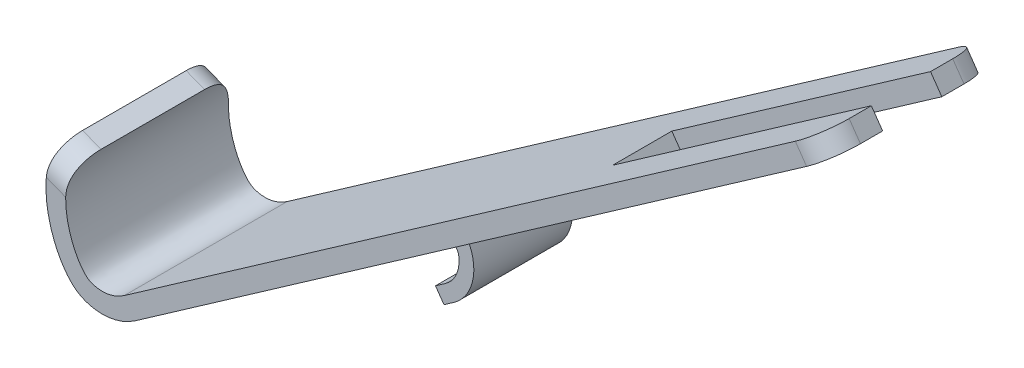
ISO-10303-21;
HEADER;
FILE_DESCRIPTION(('STEP AP214'),'2;1');
FILE_NAME('part.step','',(''),(''),'','','');
FILE_SCHEMA(('AUTOMOTIVE_DESIGN { 1 0 10303 214 1 1 1 1 }'));
ENDSEC;
DATA;
#1=APPLICATION_CONTEXT('core data for automotive mechanical design processes');
#2=APPLICATION_PROTOCOL_DEFINITION('international standard','automotive_design',2000,#1);
#3=PRODUCT_CONTEXT('',#1,'mechanical');
#4=PRODUCT('Part','Part','',(#3));
#5=PRODUCT_RELATED_PRODUCT_CATEGORY('part','',(#4));
#6=PRODUCT_DEFINITION_FORMATION('','',#4);
#7=PRODUCT_DEFINITION_CONTEXT('part definition',#1,'design');
#8=PRODUCT_DEFINITION('design','',#6,#7);
#9=PRODUCT_DEFINITION_SHAPE('','',#8);
#10=(LENGTH_UNIT() NAMED_UNIT(*) SI_UNIT(.MILLI.,.METRE.));
#11=(NAMED_UNIT(*) PLANE_ANGLE_UNIT() SI_UNIT($,.RADIAN.));
#12=(NAMED_UNIT(*) SI_UNIT($,.STERADIAN.) SOLID_ANGLE_UNIT());
#13=UNCERTAINTY_MEASURE_WITH_UNIT(LENGTH_MEASURE(1.E-05),#10,'distance_accuracy_value','');
#14=(GEOMETRIC_REPRESENTATION_CONTEXT(3) GLOBAL_UNCERTAINTY_ASSIGNED_CONTEXT((#13)) GLOBAL_UNIT_ASSIGNED_CONTEXT((#10,
#11,#12)) REPRESENTATION_CONTEXT('',''));
#15=CARTESIAN_POINT('',(0.,0.,0.));
#16=DIRECTION('',(0.,0.,1.));
#17=DIRECTION('',(1.,0.,0.));
#18=AXIS2_PLACEMENT_3D('',#15,#16,#17);
#19=CARTESIAN_POINT('',(49.1890003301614,89.4959440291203,103.384688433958));
#20=DIRECTION('',(0.819556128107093,0.572998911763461,0.));
#21=DIRECTION('',(-0.572998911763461,0.819556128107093,0.));
#22=AXIS2_PLACEMENT_3D('',#19,#20,#21);
#23=PLANE('',#22);
#24=DIRECTION('',(0.572998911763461,-0.819556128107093,0.));
#25=VECTOR('',#24,1.);
#26=CARTESIAN_POINT('',(18.4461324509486,133.467241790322,-3.00000000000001));
#27=LINE('',#26,#25);
#28=CARTESIAN_POINT('',(49.1890003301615,89.4959440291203,-3.00000000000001));
#29=VERTEX_POINT('',#28);
#30=CARTESIAN_POINT('',(50.3349981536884,87.8568317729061,-3.00000000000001));
#31=VERTEX_POINT('',#30);
#32=EDGE_CURVE('E246',#29,#31,#27,.T.);
#33=ORIENTED_EDGE('',*,*,#32,.T.);
#34=DIRECTION('',(0.,0.,-1.));
#35=VECTOR('',#34,1.);
#36=CARTESIAN_POINT('',(50.3349981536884,87.8568317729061,103.384688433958));
#37=LINE('',#36,#35);
#38=CARTESIAN_POINT('',(50.3349981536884,87.8568317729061,-5.24999999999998));
#39=VERTEX_POINT('',#38);
#40=EDGE_CURVE('E307',#31,#39,#37,.T.);
#41=ORIENTED_EDGE('',*,*,#40,.T.);
#42=DIRECTION('',(-0.572998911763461,0.819556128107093,0.));
#43=VECTOR('',#42,1.);
#44=CARTESIAN_POINT('',(49.1890003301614,89.4959440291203,-5.25));
#45=LINE('',#44,#43);
#46=CARTESIAN_POINT('',(49.1890003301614,89.4959440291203,-5.24999999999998));
#47=VERTEX_POINT('',#46);
#48=EDGE_CURVE('E294',#39,#47,#45,.T.);
#49=ORIENTED_EDGE('',*,*,#48,.T.);
#50=DIRECTION('',(0.,0.,-1.));
#51=VECTOR('',#50,1.);
#52=CARTESIAN_POINT('',(49.1890003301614,89.4959440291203,103.384688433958));
#53=LINE('',#52,#51);
#54=EDGE_CURVE('E311',#29,#47,#53,.T.);
#55=ORIENTED_EDGE('',*,*,#54,.F.);
#56=EDGE_LOOP('',(#33,#41,#49,#55));
#57=FACE_BOUND('',#56,.T.);
#58=ADVANCED_FACE('F33',(#57),#23,.T.);
#59=CARTESIAN_POINT('',(-10.7157428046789,-38.1607915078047,8.25));
#60=DIRECTION('',(0.,0.,1.));
#61=DIRECTION('',(1.,0.,0.));
#62=AXIS2_PLACEMENT_3D('',#59,#60,#61);
#63=PLANE('',#62);
#64=CARTESIAN_POINT('',(-20.1468288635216,38.5789253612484,8.25000000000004));
#65=CARTESIAN_POINT('',(-20.9028636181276,38.0503379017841,8.25000000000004));
#66=CARTESIAN_POINT('',(-21.6768857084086,37.7321559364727,8.25000000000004));
#67=CARTESIAN_POINT('',(-23.1458560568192,37.4263890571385,8.25000000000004));
#68=CARTESIAN_POINT('',(-23.8380400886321,37.4370932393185,8.25000000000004));
#69=CARTESIAN_POINT('',(-24.5954630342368,37.5732171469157,8.25000000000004));
#70=CARTESIAN_POINT('',(-24.7417051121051,37.6065813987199,8.25000000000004));
#71=CARTESIAN_POINT('',(-25.0229315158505,37.6837631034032,8.25000000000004));
#72=CARTESIAN_POINT('',(-25.1564534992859,37.7269109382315,8.25000000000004));
#73=CARTESIAN_POINT('',(-25.5510558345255,37.8749184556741,8.25000000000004));
#74=CARTESIAN_POINT('',(-25.8100579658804,38.0033692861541,8.25000000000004));
#75=CARTESIAN_POINT('',(-26.2975902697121,38.3308893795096,8.25000000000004));
#76=CARTESIAN_POINT('',(-26.5248891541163,38.5273727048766,8.25000000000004));
#77=CARTESIAN_POINT('',(-26.9573027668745,38.9755567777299,8.25000000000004));
#78=CARTESIAN_POINT('',(-27.1630045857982,39.2276609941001,8.25000000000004));
#79=CARTESIAN_POINT('',(-27.7521853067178,40.0610591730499,8.25000000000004));
#80=CARTESIAN_POINT('',(-28.1083730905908,40.7199864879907,8.25000000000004));
#81=CARTESIAN_POINT('',(-28.7039991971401,42.2017807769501,8.25000000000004));
#82=CARTESIAN_POINT('',(-28.9425063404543,43.0244901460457,8.25000000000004));
#83=CARTESIAN_POINT('',(-29.2331983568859,44.7820956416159,8.25000000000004));
#84=CARTESIAN_POINT('',(-29.2851650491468,45.7172009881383,8.25000000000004));
#85=CARTESIAN_POINT('',(-29.1242835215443,47.6392769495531,8.25000000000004));
#86=CARTESIAN_POINT('',(-28.9108138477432,48.6264707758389,8.25000000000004));
#87=CARTESIAN_POINT('',(-28.5258299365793,49.6006760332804,8.25000000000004));
#88=B_SPLINE_CURVE_WITH_KNOTS('',3,(#64,#65,#66,#67,#68,#69,#70,#71,#72,#73,#74,#75,#76,#77,#78,
#79,#80,#81,#82,#83,#84,#85,#86,#87),.UNSPECIFIED.,.F.,.F.,(4,2,2,2,2,2,2,2,2,2,2,4),(0.,
0.124999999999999,0.249999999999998,0.281249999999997,0.312499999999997,0.374999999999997,
0.437499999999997,0.499999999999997,0.624999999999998,0.749999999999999,0.874999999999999,1.),.UNSPECIFIED.);
#89=CARTESIAN_POINT('',(-20.1468288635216,38.5789253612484,8.25000000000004));
#90=VERTEX_POINT('',#89);
#91=CARTESIAN_POINT('',(-29.2075103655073,46.6443070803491,8.25000000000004));
#92=VERTEX_POINT('',#91);
#93=EDGE_CURVE('E280',#90,#92,#88,.T.);
#94=ORIENTED_EDGE('',*,*,#93,.F.);
#95=DIRECTION('',(-0.819556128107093,-0.572998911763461,0.));
#96=VECTOR('',#95,1.);
#97=CARTESIAN_POINT('',(50.3349981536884,87.8568317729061,8.25000000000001));
#98=LINE('',#97,#96);
#99=CARTESIAN_POINT('',(47.8763297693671,86.1378350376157,8.25000000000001));
#100=VERTEX_POINT('',#99);
#101=EDGE_CURVE('E273',#100,#90,#98,.T.);
#102=ORIENTED_EDGE('',*,*,#101,.F.);
#103=DIRECTION('',(0.572998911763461,-0.819556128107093,0.));
#104=VECTOR('',#103,1.);
#105=CARTESIAN_POINT('',(87.0101541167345,30.1650139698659,8.25));
#106=LINE('',#105,#104);
#107=CARTESIAN_POINT('',(46.7303319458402,87.7769472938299,8.25000000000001));
#108=VERTEX_POINT('',#107);
#109=EDGE_CURVE('E431',#100,#108,#106,.F.);
#110=ORIENTED_EDGE('',*,*,#109,.T.);
#111=DIRECTION('',(-0.819556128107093,-0.572998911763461,0.));
#112=VECTOR('',#111,1.);
#113=CARTESIAN_POINT('',(49.1890003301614,89.4959440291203,8.25000000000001));
#114=LINE('',#113,#112);
#115=CARTESIAN_POINT('',(-21.2928266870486,40.2180376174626,8.25000000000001));
#116=VERTEX_POINT('',#115);
#117=EDGE_CURVE('E295',#108,#116,#114,.T.);
#118=ORIENTED_EDGE('',*,*,#117,.T.);
#119=CARTESIAN_POINT('',(-21.2928266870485,40.2180376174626,8.25000000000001));
#120=CARTESIAN_POINT('',(-21.8352200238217,39.8388191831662,8.25000000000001));
#121=CARTESIAN_POINT('',(-22.347874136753,39.6353565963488,8.25000000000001));
#122=CARTESIAN_POINT('',(-23.2899983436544,39.4392529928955,8.25000000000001));
#123=CARTESIAN_POINT('',(-23.7222326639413,39.4483228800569,8.25000000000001));
#124=CARTESIAN_POINT('',(-24.1822002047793,39.5309881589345,8.25000000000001));
#125=CARTESIAN_POINT('',(-24.2700296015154,39.5510853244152,8.25000000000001));
#126=CARTESIAN_POINT('',(-24.4359648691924,39.596625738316,8.25000000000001));
#127=CARTESIAN_POINT('',(-24.5152747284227,39.6224747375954,8.25000000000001));
#128=CARTESIAN_POINT('',(-24.7262777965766,39.7016178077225,8.25000000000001));
#129=CARTESIAN_POINT('',(-24.8299822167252,39.7543641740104,8.25000000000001));
#130=CARTESIAN_POINT('',(-24.9928194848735,39.8637568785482,8.25000000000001));
#131=CARTESIAN_POINT('',(-25.0484683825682,39.90584826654,8.25000000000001));
#132=CARTESIAN_POINT('',(-25.1694750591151,40.009205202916,8.25000000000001));
#133=CARTESIAN_POINT('',(-25.2343633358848,40.0702468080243,8.25000000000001));
#134=CARTESIAN_POINT('',(-25.4366322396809,40.2798926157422,8.25000000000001));
#135=CARTESIAN_POINT('',(-25.5813583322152,40.454991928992,8.25000000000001));
#136=CARTESIAN_POINT('',(-26.0161636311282,41.0700255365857,8.25000000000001));
#137=CARTESIAN_POINT('',(-26.3062362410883,41.5991476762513,8.25000000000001));
#138=CARTESIAN_POINT('',(-26.7947464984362,42.8144599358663,8.25000000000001));
#139=CARTESIAN_POINT('',(-26.9941153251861,43.5008076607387,8.25000000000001));
#140=CARTESIAN_POINT('',(-27.2352003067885,44.9584751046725,8.25000000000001));
#141=CARTESIAN_POINT('',(-27.2771346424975,45.729585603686,8.25000000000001));
#142=CARTESIAN_POINT('',(-27.1462527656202,47.2932511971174,8.25000000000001));
#143=CARTESIAN_POINT('',(-26.9740580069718,48.0855830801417,8.25000000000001));
#144=CARTESIAN_POINT('',(-26.6657994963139,48.8656340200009,8.25000000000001));
#145=B_SPLINE_CURVE_WITH_KNOTS('',3,(#119,#120,#121,#122,#123,#124,#125,#126,#127,#128,#129,
#130,#131,#132,#133,#134,#135,#136,#137,#138,#139,#140,#141,#142,#143,#144),.UNSPECIFIED.,.F.,
.F.,(4,2,2,2,2,2,2,2,2,2,2,2,4),(0.,0.124999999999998,0.249999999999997,0.281249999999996,
0.312499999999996,0.374999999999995,0.406249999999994,0.437499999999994,0.499999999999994,
0.624999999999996,0.749999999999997,0.874999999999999,1.),.UNSPECIFIED.);
#146=CARTESIAN_POINT('',(-27.2419412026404,45.8675585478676,8.25000000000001));
#147=VERTEX_POINT('',#146);
#148=EDGE_CURVE('E286',#116,#147,#145,.T.);
#149=ORIENTED_EDGE('',*,*,#148,.T.);
#150=DIRECTION('',(0.93001522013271,-0.367521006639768,0.));
#151=VECTOR('',#150,1.);
#152=CARTESIAN_POINT('',(15.7729366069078,28.8690505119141,8.25));
#153=LINE('',#152,#151);
#154=EDGE_CURVE('E465',#147,#92,#153,.F.);
#155=ORIENTED_EDGE('',*,*,#154,.T.);
#156=EDGE_LOOP('',(#94,#102,#110,#118,#149,#155));
#157=FACE_BOUND('',#156,.T.);
#158=ADVANCED_FACE('F385',(#157),#63,.T.);
#159=CARTESIAN_POINT('',(-10.7157428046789,-38.1607915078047,-8.25));
#160=DIRECTION('',(0.,0.,1.));
#161=DIRECTION('',(1.,0.,0.));
#162=AXIS2_PLACEMENT_3D('',#159,#160,#161);
#163=PLANE('',#162);
#164=DIRECTION('',(-0.572998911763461,0.819556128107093,0.));
#165=VECTOR('',#164,1.);
#166=CARTESIAN_POINT('',(47.8763297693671,86.1378350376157,-8.25));
#167=LINE('',#166,#165);
#168=CARTESIAN_POINT('',(46.7303319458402,87.7769472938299,-8.25000000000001));
#169=VERTEX_POINT('',#168);
#170=CARTESIAN_POINT('',(47.8763297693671,86.1378350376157,-8.25000000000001));
#171=VERTEX_POINT('',#170);
#172=EDGE_CURVE('E429',#169,#171,#167,.F.);
#173=ORIENTED_EDGE('',*,*,#172,.T.);
#174=DIRECTION('',(0.819556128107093,0.572998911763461,0.));
#175=VECTOR('',#174,1.);
#176=CARTESIAN_POINT('',(50.3349981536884,87.8568317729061,-8.25000000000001));
#177=LINE('',#176,#175);
#178=CARTESIAN_POINT('',(-20.1468288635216,38.5789253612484,-8.25000000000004));
#179=VERTEX_POINT('',#178);
#180=EDGE_CURVE('E260',#179,#171,#177,.T.);
#181=ORIENTED_EDGE('',*,*,#180,.F.);
#182=CARTESIAN_POINT('',(-20.1468288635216,38.5789253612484,-8.25000000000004));
#183=CARTESIAN_POINT('',(-20.9028636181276,38.0503379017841,-8.25000000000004));
#184=CARTESIAN_POINT('',(-21.6768857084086,37.7321559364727,-8.25000000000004));
#185=CARTESIAN_POINT('',(-23.1458560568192,37.4263890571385,-8.25000000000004));
#186=CARTESIAN_POINT('',(-23.8380400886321,37.4370932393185,-8.25000000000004));
#187=CARTESIAN_POINT('',(-24.5954630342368,37.5732171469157,-8.25000000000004));
#188=CARTESIAN_POINT('',(-24.7417051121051,37.6065813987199,-8.25000000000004));
#189=CARTESIAN_POINT('',(-25.0229315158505,37.6837631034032,-8.25000000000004));
#190=CARTESIAN_POINT('',(-25.1564534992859,37.7269109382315,-8.25000000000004));
#191=CARTESIAN_POINT('',(-25.5510558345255,37.8749184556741,-8.25000000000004));
#192=CARTESIAN_POINT('',(-25.8100579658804,38.0033692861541,-8.25000000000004));
#193=CARTESIAN_POINT('',(-26.2975902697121,38.3308893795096,-8.25000000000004));
#194=CARTESIAN_POINT('',(-26.5248891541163,38.5273727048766,-8.25000000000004));
#195=CARTESIAN_POINT('',(-26.9573027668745,38.9755567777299,-8.25000000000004));
#196=CARTESIAN_POINT('',(-27.1630045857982,39.2276609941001,-8.25000000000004));
#197=CARTESIAN_POINT('',(-27.7521853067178,40.0610591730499,-8.25000000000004));
#198=CARTESIAN_POINT('',(-28.1083730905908,40.7199864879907,-8.25000000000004));
#199=CARTESIAN_POINT('',(-28.7039991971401,42.2017807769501,-8.25000000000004));
#200=CARTESIAN_POINT('',(-28.9425063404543,43.0244901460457,-8.25000000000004));
#201=CARTESIAN_POINT('',(-29.2331983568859,44.7820956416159,-8.25000000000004));
#202=CARTESIAN_POINT('',(-29.2851650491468,45.7172009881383,-8.25000000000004));
#203=CARTESIAN_POINT('',(-29.1242835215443,47.6392769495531,-8.25000000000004));
#204=CARTESIAN_POINT('',(-28.9108138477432,48.6264707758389,-8.25000000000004));
#205=CARTESIAN_POINT('',(-28.5258299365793,49.6006760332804,-8.25000000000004));
#206=B_SPLINE_CURVE_WITH_KNOTS('',3,(#182,#183,#184,#185,#186,#187,#188,#189,#190,#191,#192,
#193,#194,#195,#196,#197,#198,#199,#200,#201,#202,#203,#204,#205),.UNSPECIFIED.,.F.,.F.,(4,2,2,
2,2,2,2,2,2,2,2,4),(0.,0.124999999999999,0.249999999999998,0.281249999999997,0.312499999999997,
0.374999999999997,0.437499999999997,0.499999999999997,0.624999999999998,0.749999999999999,
0.874999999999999,1.),.UNSPECIFIED.);
#207=CARTESIAN_POINT('',(-29.2075103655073,46.6443070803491,-8.25000000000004));
#208=VERTEX_POINT('',#207);
#209=EDGE_CURVE('E256',#208,#179,#206,.F.);
#210=ORIENTED_EDGE('',*,*,#209,.F.);
#211=DIRECTION('',(-0.93001522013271,0.367521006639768,0.));
#212=VECTOR('',#211,1.);
#213=CARTESIAN_POINT('',(-27.7683625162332,46.0755883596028,-8.25));
#214=LINE('',#213,#212);
#215=CARTESIAN_POINT('',(-27.2419412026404,45.8675585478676,-8.25000000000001));
#216=VERTEX_POINT('',#215);
#217=EDGE_CURVE('E426',#208,#216,#214,.F.);
#218=ORIENTED_EDGE('',*,*,#217,.T.);
#219=CARTESIAN_POINT('',(-21.2928266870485,40.2180376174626,-8.25000000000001));
#220=CARTESIAN_POINT('',(-21.8352200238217,39.8388191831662,-8.25000000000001));
#221=CARTESIAN_POINT('',(-22.347874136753,39.6353565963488,-8.25000000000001));
#222=CARTESIAN_POINT('',(-23.2899983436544,39.4392529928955,-8.25000000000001));
#223=CARTESIAN_POINT('',(-23.7222326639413,39.4483228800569,-8.25000000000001));
#224=CARTESIAN_POINT('',(-24.1822002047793,39.5309881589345,-8.25000000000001));
#225=CARTESIAN_POINT('',(-24.2700296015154,39.5510853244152,-8.25000000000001));
#226=CARTESIAN_POINT('',(-24.4359648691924,39.596625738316,-8.25000000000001));
#227=CARTESIAN_POINT('',(-24.5152747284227,39.6224747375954,-8.25000000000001));
#228=CARTESIAN_POINT('',(-24.7262777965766,39.7016178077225,-8.25000000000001));
#229=CARTESIAN_POINT('',(-24.8299822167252,39.7543641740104,-8.25000000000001));
#230=CARTESIAN_POINT('',(-24.9928194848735,39.8637568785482,-8.25000000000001));
#231=CARTESIAN_POINT('',(-25.0484683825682,39.90584826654,-8.25000000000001));
#232=CARTESIAN_POINT('',(-25.1694750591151,40.009205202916,-8.25000000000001));
#233=CARTESIAN_POINT('',(-25.2343633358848,40.0702468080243,-8.25000000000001));
#234=CARTESIAN_POINT('',(-25.4366322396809,40.2798926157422,-8.25000000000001));
#235=CARTESIAN_POINT('',(-25.5813583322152,40.454991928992,-8.25000000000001));
#236=CARTESIAN_POINT('',(-26.0161636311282,41.0700255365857,-8.25000000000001));
#237=CARTESIAN_POINT('',(-26.3062362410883,41.5991476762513,-8.25000000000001));
#238=CARTESIAN_POINT('',(-26.7947464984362,42.8144599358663,-8.25000000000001));
#239=CARTESIAN_POINT('',(-26.9941153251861,43.5008076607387,-8.25000000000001));
#240=CARTESIAN_POINT('',(-27.2352003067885,44.9584751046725,-8.25000000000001));
#241=CARTESIAN_POINT('',(-27.2771346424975,45.729585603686,-8.25000000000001));
#242=CARTESIAN_POINT('',(-27.1462527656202,47.2932511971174,-8.25000000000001));
#243=CARTESIAN_POINT('',(-26.9740580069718,48.0855830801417,-8.25000000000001));
#244=CARTESIAN_POINT('',(-26.6657994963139,48.8656340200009,-8.25000000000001));
#245=B_SPLINE_CURVE_WITH_KNOTS('',3,(#219,#220,#221,#222,#223,#224,#225,#226,#227,#228,#229,
#230,#231,#232,#233,#234,#235,#236,#237,#238,#239,#240,#241,#242,#243,#244),.UNSPECIFIED.,.F.,
.F.,(4,2,2,2,2,2,2,2,2,2,2,2,4),(0.,0.124999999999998,0.249999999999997,0.281249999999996,
0.312499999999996,0.374999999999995,0.406249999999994,0.437499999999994,0.499999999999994,
0.624999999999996,0.749999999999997,0.874999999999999,1.),.UNSPECIFIED.);
#246=CARTESIAN_POINT('',(-21.2928266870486,40.2180376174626,-8.25000000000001));
#247=VERTEX_POINT('',#246);
#248=EDGE_CURVE('E268',#216,#247,#245,.F.);
#249=ORIENTED_EDGE('',*,*,#248,.T.);
#250=DIRECTION('',(0.819556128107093,0.572998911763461,0.));
#251=VECTOR('',#250,1.);
#252=CARTESIAN_POINT('',(49.1890003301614,89.4959440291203,-8.25000000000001));
#253=LINE('',#252,#251);
#254=EDGE_CURVE('E265',#247,#169,#253,.T.);
#255=ORIENTED_EDGE('',*,*,#254,.T.);
#256=EDGE_LOOP('',(#173,#181,#210,#218,#249,#255));
#257=FACE_BOUND('',#256,.T.);
#258=ADVANCED_FACE('F389',(#257),#163,.F.);
#259=CARTESIAN_POINT('',(50.3349981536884,87.8568317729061,103.384688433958));
#260=DIRECTION('',(0.572998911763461,-0.819556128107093,0.));
#261=DIRECTION('',(0.819556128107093,0.572998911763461,0.));
#262=AXIS2_PLACEMENT_3D('',#259,#260,#261);
#263=PLANE('',#262);
#264=ORIENTED_EDGE('',*,*,#101,.T.);
#265=DIRECTION('',(0.,0.,-1.));
#266=VECTOR('',#265,1.);
#267=CARTESIAN_POINT('',(-20.1468288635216,38.5789253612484,103.384688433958));
#268=LINE('',#267,#266);
#269=EDGE_CURVE('E278',#90,#179,#268,.T.);
#270=ORIENTED_EDGE('',*,*,#269,.T.);
#271=ORIENTED_EDGE('',*,*,#180,.T.);
#272=CARTESIAN_POINT('',(47.8763297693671,86.1378350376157,-5.25));
#273=DIRECTION('',(0.572998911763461,-0.819556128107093,0.));
#274=DIRECTION('',(0.819556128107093,0.572998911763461,0.));
#275=AXIS2_PLACEMENT_3D('',#272,#273,#274);
#276=CIRCLE('',#275,3.);
#277=EDGE_CURVE('E459',#171,#39,#276,.T.);
#278=ORIENTED_EDGE('',*,*,#277,.T.);
#279=ORIENTED_EDGE('',*,*,#40,.F.);
#280=DIRECTION('',(0.819556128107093,0.572998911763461,0.));
#281=VECTOR('',#280,1.);
#282=CARTESIAN_POINT('',(50.3349981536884,87.8568317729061,-3.00000000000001));
#283=LINE('',#282,#281);
#284=CARTESIAN_POINT('',(24.1092020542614,69.5208665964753,-3.00000000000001));
#285=VERTEX_POINT('',#284);
#286=EDGE_CURVE('E243',#285,#31,#283,.T.);
#287=ORIENTED_EDGE('',*,*,#286,.F.);
#288=DIRECTION('',(0.,0.,-1.));
#289=VECTOR('',#288,1.);
#290=CARTESIAN_POINT('',(24.1092020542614,69.5208665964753,2.99999999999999));
#291=LINE('',#290,#289);
#292=CARTESIAN_POINT('',(24.1092020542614,69.5208665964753,2.99999999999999));
#293=VERTEX_POINT('',#292);
#294=EDGE_CURVE('E240',#293,#285,#291,.T.);
#295=ORIENTED_EDGE('',*,*,#294,.F.);
#296=DIRECTION('',(-0.819556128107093,-0.572998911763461,0.));
#297=VECTOR('',#296,1.);
#298=CARTESIAN_POINT('',(50.3349981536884,87.8568317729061,3.00000000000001));
#299=LINE('',#298,#297);
#300=CARTESIAN_POINT('',(50.3349981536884,87.8568317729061,3.00000000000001));
#301=VERTEX_POINT('',#300);
#302=EDGE_CURVE('E237',#301,#293,#299,.T.);
#303=ORIENTED_EDGE('',*,*,#302,.F.);
#304=CARTESIAN_POINT('',(50.3349981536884,87.8568317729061,5.25000000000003));
#305=VERTEX_POINT('',#304);
#306=EDGE_CURVE('E308',#305,#301,#37,.T.);
#307=ORIENTED_EDGE('',*,*,#306,.F.);
#308=CARTESIAN_POINT('',(47.8763297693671,86.1378350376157,5.25));
#309=DIRECTION('',(0.572998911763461,-0.819556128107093,0.));
#310=DIRECTION('',(0.819556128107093,0.572998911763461,0.));
#311=AXIS2_PLACEMENT_3D('',#308,#309,#310);
#312=CIRCLE('',#311,3.);
#313=EDGE_CURVE('E467',#305,#100,#312,.T.);
#314=ORIENTED_EDGE('',*,*,#313,.T.);
#315=EDGE_LOOP('',(#264,#270,#271,#278,#279,#287,#295,#303,#307,#314));
#316=FACE_BOUND('',#315,.T.);
#317=DIRECTION('',(0.819556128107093,0.572998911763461,0.));
#318=VECTOR('',#317,1.);
#319=CARTESIAN_POINT('',(8.80161831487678,58.8184527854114,-5.));
#320=LINE('',#319,#318);
#321=CARTESIAN_POINT('',(7.78992908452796,58.111122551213,-5.));
#322=VERTEX_POINT('',#321);
#323=CARTESIAN_POINT('',(10.7786957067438,60.2007415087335,-5.));
#324=VERTEX_POINT('',#323);
#325=EDGE_CURVE('E225',#322,#324,#320,.T.);
#326=ORIENTED_EDGE('',*,*,#325,.F.);
#327=DIRECTION('',(0.,0.,-1.));
#328=VECTOR('',#327,1.);
#329=CARTESIAN_POINT('',(7.78992908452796,58.111122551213,103.384688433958));
#330=LINE('',#329,#328);
#331=CARTESIAN_POINT('',(7.78992908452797,58.111122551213,5.));
#332=VERTEX_POINT('',#331);
#333=EDGE_CURVE('E717',#322,#332,#330,.F.);
#334=ORIENTED_EDGE('',*,*,#333,.T.);
#335=DIRECTION('',(0.819556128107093,0.572998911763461,0.));
#336=VECTOR('',#335,1.);
#337=CARTESIAN_POINT('',(8.80161831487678,58.8184527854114,5.));
#338=LINE('',#337,#336);
#339=CARTESIAN_POINT('',(10.7786957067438,60.2007415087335,5.));
#340=VERTEX_POINT('',#339);
#341=EDGE_CURVE('E213',#332,#340,#338,.T.);
#342=ORIENTED_EDGE('',*,*,#341,.T.);
#343=DIRECTION('',(0.,0.,1.));
#344=VECTOR('',#343,1.);
#345=CARTESIAN_POINT('',(10.7786957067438,60.2007415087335,-5.));
#346=LINE('',#345,#344);
#347=EDGE_CURVE('E706',#340,#324,#346,.F.);
#348=ORIENTED_EDGE('',*,*,#347,.T.);
#349=EDGE_LOOP('',(#326,#334,#342,#348));
#350=FACE_BOUND('',#349,.T.);
#351=ADVANCED_FACE('F336',(#316,#350),#263,.T.);
#352=CARTESIAN_POINT('',(-21.2928266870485,40.2180376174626,103.384688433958));
#353=CARTESIAN_POINT('',(-21.8352200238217,39.8388191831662,103.384688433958));
#354=CARTESIAN_POINT('',(-22.347874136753,39.6353565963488,103.384688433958));
#355=CARTESIAN_POINT('',(-23.2899983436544,39.4392529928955,103.384688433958));
#356=CARTESIAN_POINT('',(-23.7222326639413,39.4483228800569,103.384688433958));
#357=CARTESIAN_POINT('',(-24.1822002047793,39.5309881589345,103.384688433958));
#358=CARTESIAN_POINT('',(-24.2700296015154,39.5510853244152,103.384688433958));
#359=CARTESIAN_POINT('',(-24.4359648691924,39.596625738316,103.384688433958));
#360=CARTESIAN_POINT('',(-24.5152747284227,39.6224747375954,103.384688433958));
#361=CARTESIAN_POINT('',(-24.7262777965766,39.7016178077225,103.384688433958));
#362=CARTESIAN_POINT('',(-24.8299822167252,39.7543641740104,103.384688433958));
#363=CARTESIAN_POINT('',(-24.9928194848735,39.8637568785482,103.384688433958));
#364=CARTESIAN_POINT('',(-25.0484683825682,39.90584826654,103.384688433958));
#365=CARTESIAN_POINT('',(-25.1694750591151,40.009205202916,103.384688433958));
#366=CARTESIAN_POINT('',(-25.2343633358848,40.0702468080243,103.384688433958));
#367=CARTESIAN_POINT('',(-25.4366322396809,40.2798926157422,103.384688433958));
#368=CARTESIAN_POINT('',(-25.5813583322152,40.454991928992,103.384688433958));
#369=CARTESIAN_POINT('',(-26.0161636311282,41.0700255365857,103.384688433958));
#370=CARTESIAN_POINT('',(-26.3062362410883,41.5991476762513,103.384688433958));
#371=CARTESIAN_POINT('',(-26.7947464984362,42.8144599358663,103.384688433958));
#372=CARTESIAN_POINT('',(-26.9941153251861,43.5008076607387,103.384688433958));
#373=CARTESIAN_POINT('',(-27.2352003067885,44.9584751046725,103.384688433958));
#374=CARTESIAN_POINT('',(-27.2771346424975,45.729585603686,103.384688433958));
#375=CARTESIAN_POINT('',(-27.1462527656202,47.2932511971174,103.384688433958));
#376=CARTESIAN_POINT('',(-26.9740580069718,48.0855830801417,103.384688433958));
#377=CARTESIAN_POINT('',(-26.6657994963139,48.8656340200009,103.384688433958));
#378=B_SPLINE_CURVE_WITH_KNOTS('',3,(#352,#353,#354,#355,#356,#357,#358,#359,#360,#361,#362,
#363,#364,#365,#366,#367,#368,#369,#370,#371,#372,#373,#374,#375,#376,#377),.UNSPECIFIED.,.F.,
.F.,(4,2,2,2,2,2,2,2,2,2,2,2,4),(0.,0.124999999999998,0.249999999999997,0.281249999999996,
0.312499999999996,0.374999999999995,0.406249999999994,0.437499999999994,0.499999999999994,
0.624999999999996,0.749999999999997,0.874999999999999,1.),.UNSPECIFIED.);
#379=DIRECTION('',(0.,0.,-1.));
#380=VECTOR('',#379,1.);
#381=SURFACE_OF_LINEAR_EXTRUSION('',#378,#380);
#382=DIRECTION('',(0.,0.,-1.));
#383=VECTOR('',#382,1.);
#384=CARTESIAN_POINT('',(-26.6657994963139,48.8656340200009,103.384688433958));
#385=LINE('',#384,#383);
#386=CARTESIAN_POINT('',(-26.6657994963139,48.8656340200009,5.25000000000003));
#387=VERTEX_POINT('',#386);
#388=CARTESIAN_POINT('',(-26.6657994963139,48.8656340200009,-5.24999999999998));
#389=VERTEX_POINT('',#388);
#390=EDGE_CURVE('E285',#387,#389,#385,.T.);
#391=ORIENTED_EDGE('',*,*,#390,.F.);
#392=CARTESIAN_POINT('',(-26.6657994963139,48.8656340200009,5.25));
#393=CARTESIAN_POINT('',(-26.6657874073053,48.8656378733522,5.33426346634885));
#394=CARTESIAN_POINT('',(-26.6671040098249,48.8623322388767,5.41852309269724));
#395=CARTESIAN_POINT('',(-26.6723052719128,48.8491335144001,5.58644160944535));
#396=CARTESIAN_POINT('',(-26.6761898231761,48.8392407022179,5.67010052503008));
#397=CARTESIAN_POINT('',(-26.6864351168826,48.8129057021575,5.83619036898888));
#398=CARTESIAN_POINT('',(-26.6927946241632,48.7964667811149,5.91862188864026));
#399=CARTESIAN_POINT('',(-26.7078066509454,48.7571209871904,6.08168855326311));
#400=CARTESIAN_POINT('',(-26.7164591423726,48.7342141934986,6.16232372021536));
#401=CARTESIAN_POINT('',(-26.7455398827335,48.6558749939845,6.4007694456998));
#402=CARTESIAN_POINT('',(-26.7690950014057,48.5908151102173,6.55517505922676));
#403=CARTESIAN_POINT('',(-26.8219809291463,48.436274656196,6.85003184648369));
#404=CARTESIAN_POINT('',(-26.8513107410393,48.3467983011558,6.9904854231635));
#405=CARTESIAN_POINT('',(-26.9123863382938,48.1457678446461,7.25271661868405));
#406=CARTESIAN_POINT('',(-26.9441172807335,48.0343434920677,7.37459686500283));
#407=CARTESIAN_POINT('',(-27.0066895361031,47.7917492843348,7.59701477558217));
#408=CARTESIAN_POINT('',(-27.0375311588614,47.6605864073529,7.69755995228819));
#409=CARTESIAN_POINT('',(-27.094368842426,47.3852601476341,7.87257309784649));
#410=CARTESIAN_POINT('',(-27.1204587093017,47.2414578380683,7.94757936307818));
#411=CARTESIAN_POINT('',(-27.1660930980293,46.9424986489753,8.07307178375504));
#412=CARTESIAN_POINT('',(-27.1856352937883,46.7873377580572,8.12354922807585));
#413=CARTESIAN_POINT('',(-27.2131688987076,46.5045306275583,8.19138774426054));
#414=CARTESIAN_POINT('',(-27.2227419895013,46.3781610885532,8.21354132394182));
#415=CARTESIAN_POINT('',(-27.2330109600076,46.1872888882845,8.235518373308));
#416=CARTESIAN_POINT('',(-27.2357516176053,46.1234961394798,8.24096862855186));
#417=CARTESIAN_POINT('',(-27.2398699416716,45.9956605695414,8.24820968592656));
#418=CARTESIAN_POINT('',(-27.2412476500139,45.9316177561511,8.25000060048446));
#419=CARTESIAN_POINT('',(-27.2419412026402,45.8675585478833,8.25000000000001));
#420=B_SPLINE_CURVE_WITH_KNOTS('',3,(#392,#393,#394,#395,#396,#397,#398,#399,#400,#401,#402,
#403,#404,#405,#406,#407,#408,#409,#410,#411,#412,#413,#414,#415,#416,#417,#418,#419),
.UNSPECIFIED.,.F.,.F.,(4,2,2,2,2,2,2,2,2,2,2,2,2,4),(0.,0.252708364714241,0.505406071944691,
0.757977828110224,1.01054649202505,1.51551904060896,2.02040446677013,2.52239022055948,
3.02419892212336,3.51465961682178,4.00529436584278,4.39019237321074,4.58233772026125,
4.77447716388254),.UNSPECIFIED.);
#421=EDGE_CURVE('E368',#387,#147,#420,.T.);
#422=ORIENTED_EDGE('',*,*,#421,.T.);
#423=ORIENTED_EDGE('',*,*,#148,.F.);
#424=DIRECTION('',(0.,0.,-1.));
#425=VECTOR('',#424,1.);
#426=CARTESIAN_POINT('',(-21.2928266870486,40.2180376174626,103.384688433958));
#427=LINE('',#426,#425);
#428=EDGE_CURVE('E272',#116,#247,#427,.T.);
#429=ORIENTED_EDGE('',*,*,#428,.T.);
#430=ORIENTED_EDGE('',*,*,#248,.F.);
#431=CARTESIAN_POINT('',(-27.2419412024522,45.867558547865,-8.25));
#432=CARTESIAN_POINT('',(-27.2410363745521,45.9518642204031,-8.25000854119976));
#433=CARTESIAN_POINT('',(-27.238932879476,46.0361721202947,-8.24690011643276));
#434=CARTESIAN_POINT('',(-27.2323701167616,46.2042464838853,-8.23430307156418));
#435=CARTESIAN_POINT('',(-27.2279099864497,46.2880127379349,-8.22481211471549));
#436=CARTESIAN_POINT('',(-27.2166731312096,46.4544413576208,-8.19929646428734));
#437=CARTESIAN_POINT('',(-27.2098951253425,46.5371030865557,-8.1832681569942));
#438=CARTESIAN_POINT('',(-27.1941656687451,46.7006490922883,-8.14461433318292));
#439=CARTESIAN_POINT('',(-27.185214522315,46.7815336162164,-8.12198974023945));
#440=CARTESIAN_POINT('',(-27.1653039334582,46.9411136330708,-8.07008313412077));
#441=CARTESIAN_POINT('',(-27.1543395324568,47.0198031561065,-8.04078463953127));
#442=CARTESIAN_POINT('',(-27.1306770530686,47.1741898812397,-7.97564256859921));
#443=CARTESIAN_POINT('',(-27.1179783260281,47.2498859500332,-7.93979654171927));
#444=CARTESIAN_POINT('',(-27.0911926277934,47.3975691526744,-7.8617897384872));
#445=CARTESIAN_POINT('',(-27.0771075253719,47.4695610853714,-7.81963742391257));
#446=CARTESIAN_POINT('',(-27.0479121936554,47.6094078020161,-7.72924704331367));
#447=CARTESIAN_POINT('',(-27.03280159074,47.6772610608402,-7.68100675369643));
#448=CARTESIAN_POINT('',(-26.9876883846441,47.8689955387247,-7.53140188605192));
#449=CARTESIAN_POINT('',(-26.9568342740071,47.986674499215,-7.42215796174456));
#450=CARTESIAN_POINT('',(-26.8959994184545,48.2019200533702,-7.18521656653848));
#451=CARTESIAN_POINT('',(-26.8660190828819,48.2994773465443,-7.0575106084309));
#452=CARTESIAN_POINT('',(-26.8097209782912,48.4733728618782,-6.7858271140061));
#453=CARTESIAN_POINT('',(-26.783441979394,48.54949378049,-6.64170238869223));
#454=CARTESIAN_POINT('',(-26.7376271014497,48.677832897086,-6.34222870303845));
#455=CARTESIAN_POINT('',(-26.7180891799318,48.7300583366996,-6.18688315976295));
#456=CARTESIAN_POINT('',(-26.6908079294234,48.8017472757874,-5.90128560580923));
#457=CARTESIAN_POINT('',(-26.6814800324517,48.8256955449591,-5.77229653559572));
#458=CARTESIAN_POINT('',(-26.6721000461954,48.849651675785,-5.57723988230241));
#459=CARTESIAN_POINT('',(-26.6697420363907,48.8556426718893,-5.51197000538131));
#460=CARTESIAN_POINT('',(-26.666590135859,48.8636339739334,-5.38113871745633));
#461=CARTESIAN_POINT('',(-26.6657964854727,48.8656336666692,-5.31557726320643));
#462=CARTESIAN_POINT('',(-26.6657994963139,48.8656340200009,-5.25));
#463=B_SPLINE_CURVE_WITH_KNOTS('',3,(#431,#432,#433,#434,#435,#436,#437,#438,#439,#440,#441,
#442,#443,#444,#445,#446,#447,#448,#449,#450,#451,#452,#453,#454,#455,#456,#457,#458,#459,#460,
#461,#462),.UNSPECIFIED.,.F.,.F.,(4,2,2,2,2,2,2,2,2,2,2,2,2,2,2,4),(0.,0.252888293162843,
0.505869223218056,0.758990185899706,1.01207572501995,1.26579317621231,1.5196057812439,
1.77308082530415,2.02664871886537,2.5146617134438,3.00289977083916,3.49592229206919,
3.98879530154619,4.3821981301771,4.57883298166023,4.77549804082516),.UNSPECIFIED.);
#464=EDGE_CURVE('E374',#216,#389,#463,.T.);
#465=ORIENTED_EDGE('',*,*,#464,.T.);
#466=EDGE_LOOP('',(#391,#422,#423,#429,#430,#465));
#467=FACE_BOUND('',#466,.T.);
#468=ADVANCED_FACE('F380',(#467),#381,.F.);
#469=CARTESIAN_POINT('',(-28.5258299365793,49.6006760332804,103.384688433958));
#470=DIRECTION('',(0.367521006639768,0.930015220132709,0.));
#471=DIRECTION('',(-0.93001522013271,0.367521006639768,0.));
#472=AXIS2_PLACEMENT_3D('',#469,#470,#471);
#473=PLANE('',#472);
#474=DIRECTION('',(0.,0.,-1.));
#475=VECTOR('',#474,1.);
#476=CARTESIAN_POINT('',(-28.5258299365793,49.6006760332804,103.384688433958));
#477=LINE('',#476,#475);
#478=CARTESIAN_POINT('',(-28.5258299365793,49.6006760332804,5.25000000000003));
#479=VERTEX_POINT('',#478);
#480=CARTESIAN_POINT('',(-28.5258299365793,49.6006760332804,-5.24999999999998));
#481=VERTEX_POINT('',#480);
#482=EDGE_CURVE('E279',#479,#481,#477,.T.);
#483=ORIENTED_EDGE('',*,*,#482,.F.);
#484=DIRECTION('',(0.93001522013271,-0.367521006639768,0.));
#485=VECTOR('',#484,1.);
#486=CARTESIAN_POINT('',(-28.5258299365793,49.6006760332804,5.25));
#487=LINE('',#486,#485);
#488=EDGE_CURVE('E439',#479,#387,#487,.T.);
#489=ORIENTED_EDGE('',*,*,#488,.T.);
#490=ORIENTED_EDGE('',*,*,#390,.T.);
#491=DIRECTION('',(-0.93001522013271,0.367521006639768,0.));
#492=VECTOR('',#491,1.);
#493=CARTESIAN_POINT('',(-28.5258299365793,49.6006760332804,-5.25));
#494=LINE('',#493,#492);
#495=EDGE_CURVE('E437',#389,#481,#494,.T.);
#496=ORIENTED_EDGE('',*,*,#495,.T.);
#497=EDGE_LOOP('',(#483,#489,#490,#496));
#498=FACE_BOUND('',#497,.T.);
#499=ADVANCED_FACE('F334',(#498),#473,.T.);
#500=CARTESIAN_POINT('',(-20.1468288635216,38.5789253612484,103.384688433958));
#501=CARTESIAN_POINT('',(-20.9028636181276,38.0503379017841,103.384688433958));
#502=CARTESIAN_POINT('',(-21.6768857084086,37.7321559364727,103.384688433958));
#503=CARTESIAN_POINT('',(-23.1458560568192,37.4263890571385,103.384688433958));
#504=CARTESIAN_POINT('',(-23.8380400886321,37.4370932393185,103.384688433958));
#505=CARTESIAN_POINT('',(-24.5954630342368,37.5732171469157,103.384688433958));
#506=CARTESIAN_POINT('',(-24.7417051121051,37.6065813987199,103.384688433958));
#507=CARTESIAN_POINT('',(-25.0229315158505,37.6837631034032,103.384688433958));
#508=CARTESIAN_POINT('',(-25.1564534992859,37.7269109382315,103.384688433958));
#509=CARTESIAN_POINT('',(-25.5510558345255,37.8749184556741,103.384688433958));
#510=CARTESIAN_POINT('',(-25.8100579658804,38.0033692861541,103.384688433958));
#511=CARTESIAN_POINT('',(-26.2975902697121,38.3308893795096,103.384688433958));
#512=CARTESIAN_POINT('',(-26.5248891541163,38.5273727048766,103.384688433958));
#513=CARTESIAN_POINT('',(-26.9573027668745,38.9755567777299,103.384688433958));
#514=CARTESIAN_POINT('',(-27.1630045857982,39.2276609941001,103.384688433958));
#515=CARTESIAN_POINT('',(-27.7521853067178,40.0610591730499,103.384688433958));
#516=CARTESIAN_POINT('',(-28.1083730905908,40.7199864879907,103.384688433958));
#517=CARTESIAN_POINT('',(-28.7039991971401,42.2017807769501,103.384688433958));
#518=CARTESIAN_POINT('',(-28.9425063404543,43.0244901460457,103.384688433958));
#519=CARTESIAN_POINT('',(-29.2331983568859,44.7820956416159,103.384688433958));
#520=CARTESIAN_POINT('',(-29.2851650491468,45.7172009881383,103.384688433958));
#521=CARTESIAN_POINT('',(-29.1242835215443,47.6392769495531,103.384688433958));
#522=CARTESIAN_POINT('',(-28.9108138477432,48.6264707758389,103.384688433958));
#523=CARTESIAN_POINT('',(-28.5258299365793,49.6006760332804,103.384688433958));
#524=B_SPLINE_CURVE_WITH_KNOTS('',3,(#500,#501,#502,#503,#504,#505,#506,#507,#508,#509,#510,
#511,#512,#513,#514,#515,#516,#517,#518,#519,#520,#521,#522,#523),.UNSPECIFIED.,.F.,.F.,(4,2,2,
2,2,2,2,2,2,2,2,4),(0.,0.124999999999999,0.249999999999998,0.281249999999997,0.312499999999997,
0.374999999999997,0.437499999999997,0.499999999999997,0.624999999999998,0.749999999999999,
0.874999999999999,1.),.UNSPECIFIED.);
#525=DIRECTION('',(0.,0.,-1.));
#526=VECTOR('',#525,1.);
#527=SURFACE_OF_LINEAR_EXTRUSION('',#524,#526);
#528=ORIENTED_EDGE('',*,*,#93,.T.);
#529=CARTESIAN_POINT('',(-29.2075103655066,46.644307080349,8.25));
#530=CARTESIAN_POINT('',(-29.2007631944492,46.7282372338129,8.25000922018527));
#531=CARTESIAN_POINT('',(-29.1930073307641,46.8120962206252,8.24675707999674));
#532=CARTESIAN_POINT('',(-29.1755731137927,46.9791132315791,8.23365012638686));
#533=CARTESIAN_POINT('',(-29.1658943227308,47.0622710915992,8.22379380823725));
#534=CARTESIAN_POINT('',(-29.1447122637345,47.2272887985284,8.19739841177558));
#535=CARTESIAN_POINT('',(-29.133208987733,47.3091486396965,8.18085930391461));
#536=CARTESIAN_POINT('',(-29.1085466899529,47.4709670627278,8.14109793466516));
#537=CARTESIAN_POINT('',(-29.0953878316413,47.5509258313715,8.11787633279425));
#538=CARTESIAN_POINT('',(-29.0676071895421,47.7084974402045,8.06476583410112));
#539=CARTESIAN_POINT('',(-29.0529829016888,47.7861059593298,8.03486541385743));
#540=CARTESIAN_POINT('',(-29.0225560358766,47.9382815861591,7.9685472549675));
#541=CARTESIAN_POINT('',(-29.0067530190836,48.0128475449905,7.93212708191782));
#542=CARTESIAN_POINT('',(-28.9743027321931,48.1582900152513,7.85302181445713));
#543=CARTESIAN_POINT('',(-28.9576563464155,48.229170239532,7.81034319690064));
#544=CARTESIAN_POINT('',(-28.9238515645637,48.3668268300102,7.71897661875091));
#545=CARTESIAN_POINT('',(-28.9066929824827,48.4336016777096,7.67028645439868));
#546=CARTESIAN_POINT('',(-28.8558211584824,48.6239888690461,7.51812321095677));
#547=CARTESIAN_POINT('',(-28.8218843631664,48.7412550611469,7.40659098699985));
#548=CARTESIAN_POINT('',(-28.7563317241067,48.9554443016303,7.16492084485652));
#549=CARTESIAN_POINT('',(-28.7247167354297,49.0523598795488,7.03477612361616));
#550=CARTESIAN_POINT('',(-28.6662919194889,49.2244849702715,6.75839831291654));
#551=CARTESIAN_POINT('',(-28.6395216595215,49.2995185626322,6.6120472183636));
#552=CARTESIAN_POINT('',(-28.5934702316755,49.4253306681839,6.30821813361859));
#553=CARTESIAN_POINT('',(-28.5741861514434,49.4761186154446,6.15074449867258));
#554=CARTESIAN_POINT('',(-28.5484510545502,49.543037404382,5.8690672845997));
#555=CARTESIAN_POINT('',(-28.5400017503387,49.5646445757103,5.74632192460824));
#556=CARTESIAN_POINT('',(-28.5315178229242,49.5862575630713,5.56086969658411));
#557=CARTESIAN_POINT('',(-28.5293881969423,49.5916622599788,5.49884957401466));
#558=CARTESIAN_POINT('',(-28.5265430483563,49.5988718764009,5.37455721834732));
#559=CARTESIAN_POINT('',(-28.525827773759,49.6006761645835,5.31228494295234));
#560=CARTESIAN_POINT('',(-28.5258299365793,49.6006760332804,5.25));
#561=B_SPLINE_CURVE_WITH_KNOTS('',3,(#529,#530,#531,#532,#533,#534,#535,#536,#537,#538,#539,
#540,#541,#542,#543,#544,#545,#546,#547,#548,#549,#550,#551,#552,#553,#554,#555,#556,#557,#558,
#559,#560),.UNSPECIFIED.,.F.,.F.,(4,2,2,2,2,2,2,2,2,2,2,2,2,2,2,4),(0.,0.252548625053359,
0.505154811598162,0.75776211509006,1.01034449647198,1.26336608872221,1.51648235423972,
1.76933849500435,2.02228760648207,2.51581789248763,3.00952903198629,3.50710635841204,
4.00448991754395,4.3782573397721,4.56502398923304,4.75182338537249),.UNSPECIFIED.);
#562=EDGE_CURVE('E349',#92,#479,#561,.T.);
#563=ORIENTED_EDGE('',*,*,#562,.T.);
#564=ORIENTED_EDGE('',*,*,#482,.T.);
#565=CARTESIAN_POINT('',(-28.5258299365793,49.6006760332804,-5.25));
#566=CARTESIAN_POINT('',(-28.5258196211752,49.600680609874,-5.33430501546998));
#567=CARTESIAN_POINT('',(-28.5271357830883,49.5973710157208,-5.41860619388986));
#568=CARTESIAN_POINT('',(-28.5323446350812,49.5841602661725,-5.58660675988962));
#569=CARTESIAN_POINT('',(-28.5362372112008,49.5742594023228,-5.67030617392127));
#570=CARTESIAN_POINT('',(-28.5465194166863,49.5479107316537,-5.83646718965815));
#571=CARTESIAN_POINT('',(-28.5529075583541,49.5314668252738,-5.9189294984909));
#572=CARTESIAN_POINT('',(-28.5680232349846,49.4921236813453,-6.08205580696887));
#573=CARTESIAN_POINT('',(-28.5767507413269,49.4692245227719,-6.16271982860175));
#574=CARTESIAN_POINT('',(-28.6061734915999,49.390947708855,-6.40124447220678));
#575=CARTESIAN_POINT('',(-28.6301128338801,49.325981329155,-6.55569699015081));
#576=CARTESIAN_POINT('',(-28.6844356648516,49.1718610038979,-6.85065185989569));
#577=CARTESIAN_POINT('',(-28.7148180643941,49.0827111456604,-6.99115656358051));
#578=CARTESIAN_POINT('',(-28.7791676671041,48.8824724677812,-7.25380201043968));
#579=CARTESIAN_POINT('',(-28.8131211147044,48.7714664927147,-7.37600912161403));
#580=CARTESIAN_POINT('',(-28.8816915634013,48.5299651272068,-7.59910045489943));
#581=CARTESIAN_POINT('',(-28.9163084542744,48.3994729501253,-7.69998818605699));
#582=CARTESIAN_POINT('',(-28.9827399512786,48.1245372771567,-7.87632692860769));
#583=CARTESIAN_POINT('',(-29.0145885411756,47.9803297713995,-7.95213347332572));
#584=CARTESIAN_POINT('',(-29.0735825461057,47.6803602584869,-8.07858406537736));
#585=CARTESIAN_POINT('',(-29.1007278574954,47.5245979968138,-8.12922755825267));
#586=CARTESIAN_POINT('',(-29.1422596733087,47.2476985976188,-8.19479983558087));
#587=CARTESIAN_POINT('',(-29.1581269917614,47.1281372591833,-8.21560072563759));
#588=CARTESIAN_POINT('',(-29.1789301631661,46.9474090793,-8.23629882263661));
#589=CARTESIAN_POINT('',(-29.1853614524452,46.8869782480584,-8.24144771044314));
#590=CARTESIAN_POINT('',(-29.1972059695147,46.7658174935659,-8.24829889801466));
#591=CARTESIAN_POINT('',(-29.2026191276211,46.7050875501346,-8.25000096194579));
#592=CARTESIAN_POINT('',(-29.2075103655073,46.6443070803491,-8.24999999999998));
#593=B_SPLINE_CURVE_WITH_KNOTS('',3,(#565,#566,#567,#568,#569,#570,#571,#572,#573,#574,#575,
#576,#577,#578,#579,#580,#581,#582,#583,#584,#585,#586,#587,#588,#589,#590,#591,#592),
.UNSPECIFIED.,.F.,.F.,(4,2,2,2,2,2,2,2,2,2,2,2,2,4),(0.,0.252832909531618,0.505654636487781,
0.758325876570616,1.01099402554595,1.51615205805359,2.02122476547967,2.52441864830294,
3.02752964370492,3.52316840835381,4.01881809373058,4.38507905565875,4.56795286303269,
4.75083918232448),.UNSPECIFIED.);
#594=EDGE_CURVE('E341',#481,#208,#593,.T.);
#595=ORIENTED_EDGE('',*,*,#594,.T.);
#596=ORIENTED_EDGE('',*,*,#209,.T.);
#597=ORIENTED_EDGE('',*,*,#269,.F.);
#598=EDGE_LOOP('',(#528,#563,#564,#595,#596,#597));
#599=FACE_BOUND('',#598,.T.);
#600=ADVANCED_FACE('F328',(#599),#527,.T.);
#601=DIRECTION('',(0.572998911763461,-0.819556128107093,0.));
#602=VECTOR('',#601,1.);
#603=CARTESIAN_POINT('',(18.4461324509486,133.467241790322,3.00000000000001));
#604=LINE('',#603,#602);
#605=CARTESIAN_POINT('',(49.1890003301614,89.4959440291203,3.00000000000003));
#606=VERTEX_POINT('',#605);
#607=EDGE_CURVE('E245',#606,#301,#604,.T.);
#608=ORIENTED_EDGE('',*,*,#607,.F.);
#609=CARTESIAN_POINT('',(49.1890003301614,89.4959440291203,5.25000000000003));
#610=VERTEX_POINT('',#609);
#611=EDGE_CURVE('E300',#610,#606,#53,.T.);
#612=ORIENTED_EDGE('',*,*,#611,.F.);
#613=DIRECTION('',(0.572998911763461,-0.819556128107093,0.));
#614=VECTOR('',#613,1.);
#615=CARTESIAN_POINT('',(49.1890003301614,89.4959440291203,5.25));
#616=LINE('',#615,#614);
#617=EDGE_CURVE('E472',#610,#305,#616,.T.);
#618=ORIENTED_EDGE('',*,*,#617,.T.);
#619=ORIENTED_EDGE('',*,*,#306,.T.);
#620=EDGE_LOOP('',(#608,#612,#618,#619));
#621=FACE_BOUND('',#620,.T.);
#622=ADVANCED_FACE('F333',(#621),#23,.T.);
#623=CARTESIAN_POINT('',(49.1890003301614,89.4959440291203,103.384688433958));
#624=DIRECTION('',(0.572998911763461,-0.819556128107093,0.));
#625=DIRECTION('',(0.819556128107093,0.572998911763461,0.));
#626=AXIS2_PLACEMENT_3D('',#623,#624,#625);
#627=PLANE('',#626);
#628=DIRECTION('',(0.,0.,1.));
#629=VECTOR('',#628,1.);
#630=CARTESIAN_POINT('',(22.9632042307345,71.1599788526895,2.99999999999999));
#631=LINE('',#630,#629);
#632=CARTESIAN_POINT('',(22.9632042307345,71.1599788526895,-3.00000000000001));
#633=VERTEX_POINT('',#632);
#634=CARTESIAN_POINT('',(22.9632042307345,71.1599788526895,3.));
#635=VERTEX_POINT('',#634);
#636=EDGE_CURVE('E203',#633,#635,#631,.T.);
#637=ORIENTED_EDGE('',*,*,#636,.F.);
#638=DIRECTION('',(-0.819556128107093,-0.572998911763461,0.));
#639=VECTOR('',#638,1.);
#640=CARTESIAN_POINT('',(49.1890003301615,89.4959440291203,-3.00000000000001));
#641=LINE('',#640,#639);
#642=EDGE_CURVE('E234',#29,#633,#641,.T.);
#643=ORIENTED_EDGE('',*,*,#642,.F.);
#644=ORIENTED_EDGE('',*,*,#54,.T.);
#645=CARTESIAN_POINT('',(46.7303319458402,87.7769472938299,-5.25));
#646=DIRECTION('',(0.572998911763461,-0.819556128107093,0.));
#647=DIRECTION('',(0.819556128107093,0.572998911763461,0.));
#648=AXIS2_PLACEMENT_3D('',#645,#646,#647);
#649=CIRCLE('',#648,3.);
#650=EDGE_CURVE('E427',#47,#169,#649,.F.);
#651=ORIENTED_EDGE('',*,*,#650,.T.);
#652=ORIENTED_EDGE('',*,*,#254,.F.);
#653=ORIENTED_EDGE('',*,*,#428,.F.);
#654=ORIENTED_EDGE('',*,*,#117,.F.);
#655=CARTESIAN_POINT('',(46.7303319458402,87.7769472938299,5.25));
#656=DIRECTION('',(0.572998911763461,-0.819556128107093,0.));
#657=DIRECTION('',(0.819556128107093,0.572998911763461,0.));
#658=AXIS2_PLACEMENT_3D('',#655,#656,#657);
#659=CIRCLE('',#658,3.);
#660=EDGE_CURVE('E423',#108,#610,#659,.F.);
#661=ORIENTED_EDGE('',*,*,#660,.T.);
#662=ORIENTED_EDGE('',*,*,#611,.T.);
#663=DIRECTION('',(0.819556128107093,0.572998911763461,0.));
#664=VECTOR('',#663,1.);
#665=CARTESIAN_POINT('',(49.1890003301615,89.4959440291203,3.00000000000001));
#666=LINE('',#665,#664);
#667=EDGE_CURVE('E249',#635,#606,#666,.T.);
#668=ORIENTED_EDGE('',*,*,#667,.F.);
#669=EDGE_LOOP('',(#637,#643,#644,#651,#652,#653,#654,#661,#662,#668));
#670=FACE_BOUND('',#669,.T.);
#671=ADVANCED_FACE('F395',(#670),#627,.F.);
#672=CARTESIAN_POINT('',(46.7303319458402,87.7769472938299,5.25));
#673=DIRECTION('',(0.572998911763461,-0.819556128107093,0.));
#674=DIRECTION('',(0.819556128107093,0.572998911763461,0.));
#675=AXIS2_PLACEMENT_3D('',#672,#673,#674);
#676=CYLINDRICAL_SURFACE('',#675,3.);
#677=ORIENTED_EDGE('',*,*,#660,.F.);
#678=ORIENTED_EDGE('',*,*,#109,.F.);
#679=ORIENTED_EDGE('',*,*,#313,.F.);
#680=ORIENTED_EDGE('',*,*,#617,.F.);
#681=EDGE_LOOP('',(#677,#678,#679,#680));
#682=FACE_BOUND('',#681,.T.);
#683=ADVANCED_FACE('F393',(#682),#676,.T.);
#684=CARTESIAN_POINT('',(46.7303319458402,87.7769472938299,-5.25));
#685=DIRECTION('',(0.572998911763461,-0.819556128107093,0.));
#686=DIRECTION('',(0.819556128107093,0.572998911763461,0.));
#687=AXIS2_PLACEMENT_3D('',#684,#685,#686);
#688=CYLINDRICAL_SURFACE('',#687,3.);
#689=ORIENTED_EDGE('',*,*,#277,.F.);
#690=ORIENTED_EDGE('',*,*,#172,.F.);
#691=ORIENTED_EDGE('',*,*,#650,.F.);
#692=ORIENTED_EDGE('',*,*,#48,.F.);
#693=EDGE_LOOP('',(#689,#690,#691,#692));
#694=FACE_BOUND('',#693,.T.);
#695=ADVANCED_FACE('F363',(#694),#688,.T.);
#696=CARTESIAN_POINT('',(-29.6283929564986,46.8106303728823,5.25));
#697=DIRECTION('',(0.93001522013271,-0.367521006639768,0.));
#698=DIRECTION('',(0.367521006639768,0.93001522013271,0.));
#699=AXIS2_PLACEMENT_3D('',#696,#697,#698);
#700=CYLINDRICAL_SURFACE('',#699,3.);
#701=ORIENTED_EDGE('',*,*,#562,.F.);
#702=ORIENTED_EDGE('',*,*,#154,.F.);
#703=ORIENTED_EDGE('',*,*,#421,.F.);
#704=ORIENTED_EDGE('',*,*,#488,.F.);
#705=EDGE_LOOP('',(#701,#702,#703,#704));
#706=FACE_BOUND('',#705,.T.);
#707=ADVANCED_FACE('F358',(#706),#700,.T.);
#708=CARTESIAN_POINT('',(-29.6283929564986,46.8106303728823,-5.25));
#709=DIRECTION('',(0.93001522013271,-0.367521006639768,0.));
#710=DIRECTION('',(0.367521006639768,0.93001522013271,0.));
#711=AXIS2_PLACEMENT_3D('',#708,#709,#710);
#712=CYLINDRICAL_SURFACE('',#711,3.);
#713=ORIENTED_EDGE('',*,*,#464,.F.);
#714=ORIENTED_EDGE('',*,*,#217,.F.);
#715=ORIENTED_EDGE('',*,*,#594,.F.);
#716=ORIENTED_EDGE('',*,*,#495,.F.);
#717=EDGE_LOOP('',(#713,#714,#715,#716));
#718=FACE_BOUND('',#717,.T.);
#719=ADVANCED_FACE('F362',(#718),#712,.T.);
#720=CARTESIAN_POINT('',(18.4461324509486,133.467241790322,-3.00000000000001));
#721=DIRECTION('',(0.,0.,-1.));
#722=DIRECTION('',(-1.,0.,0.));
#723=AXIS2_PLACEMENT_3D('',#720,#721,#722);
#724=PLANE('',#723);
#725=ORIENTED_EDGE('',*,*,#642,.T.);
#726=DIRECTION('',(0.572998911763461,-0.819556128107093,0.));
#727=VECTOR('',#726,1.);
#728=CARTESIAN_POINT('',(-7.77966364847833,115.131276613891,-3.00000000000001));
#729=LINE('',#728,#727);
#730=EDGE_CURVE('E250',#633,#285,#729,.T.);
#731=ORIENTED_EDGE('',*,*,#730,.T.);
#732=ORIENTED_EDGE('',*,*,#286,.T.);
#733=ORIENTED_EDGE('',*,*,#32,.F.);
#734=EDGE_LOOP('',(#725,#731,#732,#733));
#735=FACE_BOUND('',#734,.T.);
#736=ADVANCED_FACE('F479',(#735),#724,.F.);
#737=CARTESIAN_POINT('',(-7.77966364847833,115.131276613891,2.99999999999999));
#738=DIRECTION('',(-0.819556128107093,-0.572998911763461,0.));
#739=DIRECTION('',(0.572998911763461,-0.819556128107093,0.));
#740=AXIS2_PLACEMENT_3D('',#737,#738,#739);
#741=PLANE('',#740);
#742=ORIENTED_EDGE('',*,*,#636,.T.);
#743=DIRECTION('',(0.572998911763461,-0.819556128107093,0.));
#744=VECTOR('',#743,1.);
#745=CARTESIAN_POINT('',(-7.77966364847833,115.131276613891,2.99999999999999));
#746=LINE('',#745,#744);
#747=EDGE_CURVE('E252',#635,#293,#746,.T.);
#748=ORIENTED_EDGE('',*,*,#747,.T.);
#749=ORIENTED_EDGE('',*,*,#294,.T.);
#750=ORIENTED_EDGE('',*,*,#730,.F.);
#751=EDGE_LOOP('',(#742,#748,#749,#750));
#752=FACE_BOUND('',#751,.T.);
#753=ADVANCED_FACE('F483',(#752),#741,.F.);
#754=CARTESIAN_POINT('',(18.4461324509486,133.467241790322,3.00000000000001));
#755=DIRECTION('',(0.,0.,1.));
#756=DIRECTION('',(1.,0.,0.));
#757=AXIS2_PLACEMENT_3D('',#754,#755,#756);
#758=PLANE('',#757);
#759=ORIENTED_EDGE('',*,*,#667,.T.);
#760=ORIENTED_EDGE('',*,*,#607,.T.);
#761=ORIENTED_EDGE('',*,*,#302,.T.);
#762=ORIENTED_EDGE('',*,*,#747,.F.);
#763=EDGE_LOOP('',(#759,#760,#761,#762));
#764=FACE_BOUND('',#763,.T.);
#765=ADVANCED_FACE('F485',(#764),#758,.F.);
#766=CARTESIAN_POINT('',(8.00030736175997,54.2926489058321,5.));
#767=DIRECTION('',(0.572998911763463,-0.819556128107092,0.));
#768=DIRECTION('',(0.819556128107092,0.572998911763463,0.));
#769=AXIS2_PLACEMENT_3D('',#766,#767,#768);
#770=PLANE('',#769);
#771=DIRECTION('',(-0.819556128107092,-0.572998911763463,0.));
#772=VECTOR('',#771,1.);
#773=CARTESIAN_POINT('',(8.00030736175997,54.2926489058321,-5.));
#774=LINE('',#773,#772);
#775=CARTESIAN_POINT('',(8.00030736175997,54.2926489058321,-5.));
#776=VERTEX_POINT('',#775);
#777=CARTESIAN_POINT('',(7.00030736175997,53.5934912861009,-5.));
#778=VERTEX_POINT('',#777);
#779=EDGE_CURVE('E199',#776,#778,#774,.T.);
#780=ORIENTED_EDGE('',*,*,#779,.T.);
#781=DIRECTION('',(0.,0.,-1.));
#782=VECTOR('',#781,1.);
#783=CARTESIAN_POINT('',(7.00030736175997,53.5934912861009,5.));
#784=LINE('',#783,#782);
#785=CARTESIAN_POINT('',(7.00030736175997,53.5934912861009,5.));
#786=VERTEX_POINT('',#785);
#787=EDGE_CURVE('E196',#786,#778,#784,.T.);
#788=ORIENTED_EDGE('',*,*,#787,.F.);
#789=DIRECTION('',(-0.819556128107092,-0.572998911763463,0.));
#790=VECTOR('',#789,1.);
#791=CARTESIAN_POINT('',(8.00030736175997,54.2926489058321,5.));
#792=LINE('',#791,#790);
#793=CARTESIAN_POINT('',(8.00030736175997,54.2926489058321,5.));
#794=VERTEX_POINT('',#793);
#795=EDGE_CURVE('E181',#794,#786,#792,.T.);
#796=ORIENTED_EDGE('',*,*,#795,.F.);
#797=DIRECTION('',(0.,0.,-1.));
#798=VECTOR('',#797,1.);
#799=CARTESIAN_POINT('',(8.00030736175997,54.2926489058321,5.));
#800=LINE('',#799,#798);
#801=EDGE_CURVE('E216',#794,#776,#800,.T.);
#802=ORIENTED_EDGE('',*,*,#801,.T.);
#803=EDGE_LOOP('',(#780,#788,#796,#802));
#804=FACE_BOUND('',#803,.T.);
#805=ADVANCED_FACE('F197',(#804),#770,.F.);
#806=CARTESIAN_POINT('',(7.85980572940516,52.3641570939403,5.));
#807=DIRECTION('',(-0.81955612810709,-0.572998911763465,0.));
#808=DIRECTION('',(0.572998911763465,-0.81955612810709,0.));
#809=AXIS2_PLACEMENT_3D('',#806,#807,#808);
#810=PLANE('',#809);
#811=DIRECTION('',(-0.572998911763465,0.81955612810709,0.));
#812=VECTOR('',#811,1.);
#813=CARTESIAN_POINT('',(7.85980572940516,52.3641570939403,-5.));
#814=LINE('',#813,#812);
#815=CARTESIAN_POINT('',(7.85980572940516,52.3641570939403,-5.));
#816=VERTEX_POINT('',#815);
#817=EDGE_CURVE('E218',#816,#778,#814,.T.);
#818=ORIENTED_EDGE('',*,*,#817,.F.);
#819=DIRECTION('',(0.,0.,-1.));
#820=VECTOR('',#819,1.);
#821=CARTESIAN_POINT('',(7.85980572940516,52.3641570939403,5.));
#822=LINE('',#821,#820);
#823=CARTESIAN_POINT('',(7.85980572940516,52.3641570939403,5.));
#824=VERTEX_POINT('',#823);
#825=EDGE_CURVE('E204',#824,#816,#822,.T.);
#826=ORIENTED_EDGE('',*,*,#825,.F.);
#827=DIRECTION('',(-0.572998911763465,0.81955612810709,0.));
#828=VECTOR('',#827,1.);
#829=CARTESIAN_POINT('',(7.85980572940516,52.3641570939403,5.));
#830=LINE('',#829,#828);
#831=EDGE_CURVE('E186',#824,#786,#830,.T.);
#832=ORIENTED_EDGE('',*,*,#831,.T.);
#833=ORIENTED_EDGE('',*,*,#787,.T.);
#834=EDGE_LOOP('',(#818,#826,#832,#833));
#835=FACE_BOUND('',#834,.T.);
#836=ADVANCED_FACE('F206',(#835),#810,.T.);
#837=CARTESIAN_POINT('',(8.85980572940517,53.0633147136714,5.));
#838=DIRECTION('',(0.572998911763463,-0.819556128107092,0.));
#839=DIRECTION('',(0.819556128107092,0.572998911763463,0.));
#840=AXIS2_PLACEMENT_3D('',#837,#838,#839);
#841=PLANE('',#840);
#842=DIRECTION('',(-0.819556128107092,-0.572998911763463,0.));
#843=VECTOR('',#842,1.);
#844=CARTESIAN_POINT('',(8.85980572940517,53.0633147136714,-5.));
#845=LINE('',#844,#843);
#846=CARTESIAN_POINT('',(8.85980572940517,53.0633147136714,-5.));
#847=VERTEX_POINT('',#846);
#848=EDGE_CURVE('E220',#847,#816,#845,.T.);
#849=ORIENTED_EDGE('',*,*,#848,.F.);
#850=DIRECTION('',(0.,0.,-1.));
#851=VECTOR('',#850,1.);
#852=CARTESIAN_POINT('',(8.85980572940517,53.0633147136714,5.));
#853=LINE('',#852,#851);
#854=CARTESIAN_POINT('',(8.85980572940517,53.0633147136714,5.));
#855=VERTEX_POINT('',#854);
#856=EDGE_CURVE('E229',#855,#847,#853,.T.);
#857=ORIENTED_EDGE('',*,*,#856,.F.);
#858=DIRECTION('',(-0.819556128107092,-0.572998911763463,0.));
#859=VECTOR('',#858,1.);
#860=CARTESIAN_POINT('',(8.85980572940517,53.0633147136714,5.));
#861=LINE('',#860,#859);
#862=EDGE_CURVE('E207',#855,#824,#861,.T.);
#863=ORIENTED_EDGE('',*,*,#862,.T.);
#864=ORIENTED_EDGE('',*,*,#825,.T.);
#865=EDGE_LOOP('',(#849,#857,#863,#864));
#866=FACE_BOUND('',#865,.T.);
#867=ADVANCED_FACE('F499',(#866),#841,.T.);
#868=CARTESIAN_POINT('',(6.13806089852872,56.9562063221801,5.));
#869=DIRECTION('',(0.,0.,-1.));
#870=DIRECTION('',(-1.,0.,0.));
#871=AXIS2_PLACEMENT_3D('',#868,#869,#870);
#872=CYLINDRICAL_SURFACE('',#871,4.75);
#873=CARTESIAN_POINT('',(6.13806089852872,56.9562063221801,-5.));
#874=DIRECTION('',(0.,0.,1.));
#875=DIRECTION('',(1.,0.,0.));
#876=AXIS2_PLACEMENT_3D('',#873,#874,#875);
#877=CIRCLE('',#876,4.75);
#878=CARTESIAN_POINT('',(10.4449757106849,58.9594498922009,-5.));
#879=VERTEX_POINT('',#878);
#880=EDGE_CURVE('E223',#879,#847,#877,.F.);
#881=ORIENTED_EDGE('',*,*,#880,.F.);
#882=DIRECTION('',(0.,0.,-1.));
#883=VECTOR('',#882,1.);
#884=CARTESIAN_POINT('',(10.4449757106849,58.9594498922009,5.));
#885=LINE('',#884,#883);
#886=CARTESIAN_POINT('',(10.4449757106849,58.9594498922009,5.));
#887=VERTEX_POINT('',#886);
#888=EDGE_CURVE('E48',#879,#887,#885,.F.);
#889=ORIENTED_EDGE('',*,*,#888,.T.);
#890=CARTESIAN_POINT('',(6.13806089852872,56.9562063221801,5.));
#891=DIRECTION('',(0.,0.,1.));
#892=DIRECTION('',(1.,0.,0.));
#893=AXIS2_PLACEMENT_3D('',#890,#891,#892);
#894=CIRCLE('',#893,4.75);
#895=EDGE_CURVE('E209',#887,#855,#894,.F.);
#896=ORIENTED_EDGE('',*,*,#895,.T.);
#897=ORIENTED_EDGE('',*,*,#856,.T.);
#898=EDGE_LOOP('',(#881,#889,#896,#897));
#899=FACE_BOUND('',#898,.T.);
#900=ADVANCED_FACE('F502',(#899),#872,.T.);
#901=CARTESIAN_POINT('',(6.13806089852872,56.9562063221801,5.));
#902=DIRECTION('',(0.,0.,-1.));
#903=DIRECTION('',(-1.,0.,0.));
#904=AXIS2_PLACEMENT_3D('',#901,#902,#903);
#905=CYLINDRICAL_SURFACE('',#904,3.25);
#906=CARTESIAN_POINT('',(6.13806089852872,56.9562063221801,5.));
#907=DIRECTION('',(0.,0.,1.));
#908=DIRECTION('',(1.,0.,0.));
#909=AXIS2_PLACEMENT_3D('',#906,#907,#908);
#910=CIRCLE('',#909,3.25);
#911=CARTESIAN_POINT('',(9.35175781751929,57.4406153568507,5.));
#912=VERTEX_POINT('',#911);
#913=EDGE_CURVE('E189',#912,#794,#910,.F.);
#914=ORIENTED_EDGE('',*,*,#913,.F.);
#915=DIRECTION('',(0.,0.,-1.));
#916=VECTOR('',#915,1.);
#917=CARTESIAN_POINT('',(9.35175781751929,57.4406153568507,5.));
#918=LINE('',#917,#916);
#919=CARTESIAN_POINT('',(9.35175781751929,57.4406153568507,-5.));
#920=VERTEX_POINT('',#919);
#921=EDGE_CURVE('E356',#912,#920,#918,.T.);
#922=ORIENTED_EDGE('',*,*,#921,.T.);
#923=CARTESIAN_POINT('',(6.13806089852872,56.9562063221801,-5.));
#924=DIRECTION('',(0.,0.,1.));
#925=DIRECTION('',(1.,0.,0.));
#926=AXIS2_PLACEMENT_3D('',#923,#924,#925);
#927=CIRCLE('',#926,3.25);
#928=EDGE_CURVE('E193',#920,#776,#927,.F.);
#929=ORIENTED_EDGE('',*,*,#928,.T.);
#930=ORIENTED_EDGE('',*,*,#801,.F.);
#931=EDGE_LOOP('',(#914,#922,#929,#930));
#932=FACE_BOUND('',#931,.T.);
#933=ADVANCED_FACE('F506',(#932),#905,.F.);
#934=CARTESIAN_POINT('',(6.13806089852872,56.9562063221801,5.));
#935=DIRECTION('',(0.,0.,1.));
#936=DIRECTION('',(1.,0.,0.));
#937=AXIS2_PLACEMENT_3D('',#934,#935,#936);
#938=PLANE('',#937);
#939=ORIENTED_EDGE('',*,*,#795,.T.);
#940=ORIENTED_EDGE('',*,*,#831,.F.);
#941=ORIENTED_EDGE('',*,*,#862,.F.);
#942=ORIENTED_EDGE('',*,*,#895,.F.);
#943=CARTESIAN_POINT('',(11.3516946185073,59.3811853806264,5.));
#944=DIRECTION('',(0.,0.,1.));
#945=DIRECTION('',(1.,0.,0.));
#946=AXIS2_PLACEMENT_3D('',#943,#944,#945);
#947=CIRCLE('',#946,1.);
#948=EDGE_CURVE('E11',#887,#340,#947,.F.);
#949=ORIENTED_EDGE('',*,*,#948,.T.);
#950=ORIENTED_EDGE('',*,*,#341,.F.);
#951=CARTESIAN_POINT('',(8.36292799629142,57.2915664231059,5.));
#952=DIRECTION('',(0.,0.,1.));
#953=DIRECTION('',(1.,0.,0.));
#954=AXIS2_PLACEMENT_3D('',#951,#952,#953);
#955=CIRCLE('',#954,1.);
#956=EDGE_CURVE('E722',#332,#912,#955,.F.);
#957=ORIENTED_EDGE('',*,*,#956,.T.);
#958=ORIENTED_EDGE('',*,*,#913,.T.);
#959=EDGE_LOOP('',(#939,#940,#941,#942,#949,#950,#957,#958));
#960=FACE_BOUND('',#959,.T.);
#961=ADVANCED_FACE('F183',(#960),#938,.T.);
#962=CARTESIAN_POINT('',(6.13806089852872,56.9562063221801,-5.));
#963=DIRECTION('',(0.,0.,1.));
#964=DIRECTION('',(1.,0.,0.));
#965=AXIS2_PLACEMENT_3D('',#962,#963,#964);
#966=PLANE('',#965);
#967=ORIENTED_EDGE('',*,*,#779,.F.);
#968=ORIENTED_EDGE('',*,*,#928,.F.);
#969=CARTESIAN_POINT('',(8.36292799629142,57.2915664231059,-5.));
#970=DIRECTION('',(0.,0.,1.));
#971=DIRECTION('',(1.,0.,0.));
#972=AXIS2_PLACEMENT_3D('',#969,#970,#971);
#973=CIRCLE('',#972,1.);
#974=EDGE_CURVE('E712',#920,#322,#973,.T.);
#975=ORIENTED_EDGE('',*,*,#974,.T.);
#976=ORIENTED_EDGE('',*,*,#325,.T.);
#977=CARTESIAN_POINT('',(11.3516946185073,59.3811853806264,-5.));
#978=DIRECTION('',(0.,0.,1.));
#979=DIRECTION('',(1.,0.,0.));
#980=AXIS2_PLACEMENT_3D('',#977,#978,#979);
#981=CIRCLE('',#980,1.);
#982=EDGE_CURVE('E41',#324,#879,#981,.T.);
#983=ORIENTED_EDGE('',*,*,#982,.T.);
#984=ORIENTED_EDGE('',*,*,#880,.T.);
#985=ORIENTED_EDGE('',*,*,#848,.T.);
#986=ORIENTED_EDGE('',*,*,#817,.T.);
#987=EDGE_LOOP('',(#967,#968,#975,#976,#983,#984,#985,#986));
#988=FACE_BOUND('',#987,.T.);
#989=ADVANCED_FACE('F510',(#988),#966,.F.);
#990=CARTESIAN_POINT('',(8.36292799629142,57.2915664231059,5.));
#991=DIRECTION('',(0.,0.,-1.));
#992=DIRECTION('',(-1.,0.,0.));
#993=AXIS2_PLACEMENT_3D('',#990,#991,#992);
#994=CYLINDRICAL_SURFACE('',#993,1.);
#995=ORIENTED_EDGE('',*,*,#956,.F.);
#996=ORIENTED_EDGE('',*,*,#333,.F.);
#997=ORIENTED_EDGE('',*,*,#974,.F.);
#998=ORIENTED_EDGE('',*,*,#921,.F.);
#999=EDGE_LOOP('',(#995,#996,#997,#998));
#1000=FACE_BOUND('',#999,.T.);
#1001=ADVANCED_FACE('F513',(#1000),#994,.F.);
#1002=CARTESIAN_POINT('',(11.3516946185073,59.3811853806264,5.));
#1003=DIRECTION('',(0.,0.,-1.));
#1004=DIRECTION('',(-1.,0.,0.));
#1005=AXIS2_PLACEMENT_3D('',#1002,#1003,#1004);
#1006=CYLINDRICAL_SURFACE('',#1005,1.);
#1007=ORIENTED_EDGE('',*,*,#948,.F.);
#1008=ORIENTED_EDGE('',*,*,#888,.F.);
#1009=ORIENTED_EDGE('',*,*,#982,.F.);
#1010=ORIENTED_EDGE('',*,*,#347,.F.);
#1011=EDGE_LOOP('',(#1007,#1008,#1009,#1010));
#1012=FACE_BOUND('',#1011,.T.);
#1013=ADVANCED_FACE('F35',(#1012),#1006,.F.);
#1014=CLOSED_SHELL('',(#58,#158,#258,#351,#468,#499,#600,#622,#671,#683,#695,#707,#719,#736,
#753,#765,#805,#836,#867,#900,#933,#961,#989,#1001,#1013));
#1015=MANIFOLD_SOLID_BREP('B2',#1014);
#1016=ADVANCED_BREP_SHAPE_REPRESENTATION('',(#18,#1015),#14);
#1017=SHAPE_DEFINITION_REPRESENTATION(#9,#1016);
ENDSEC;
END-ISO-10303-21;
